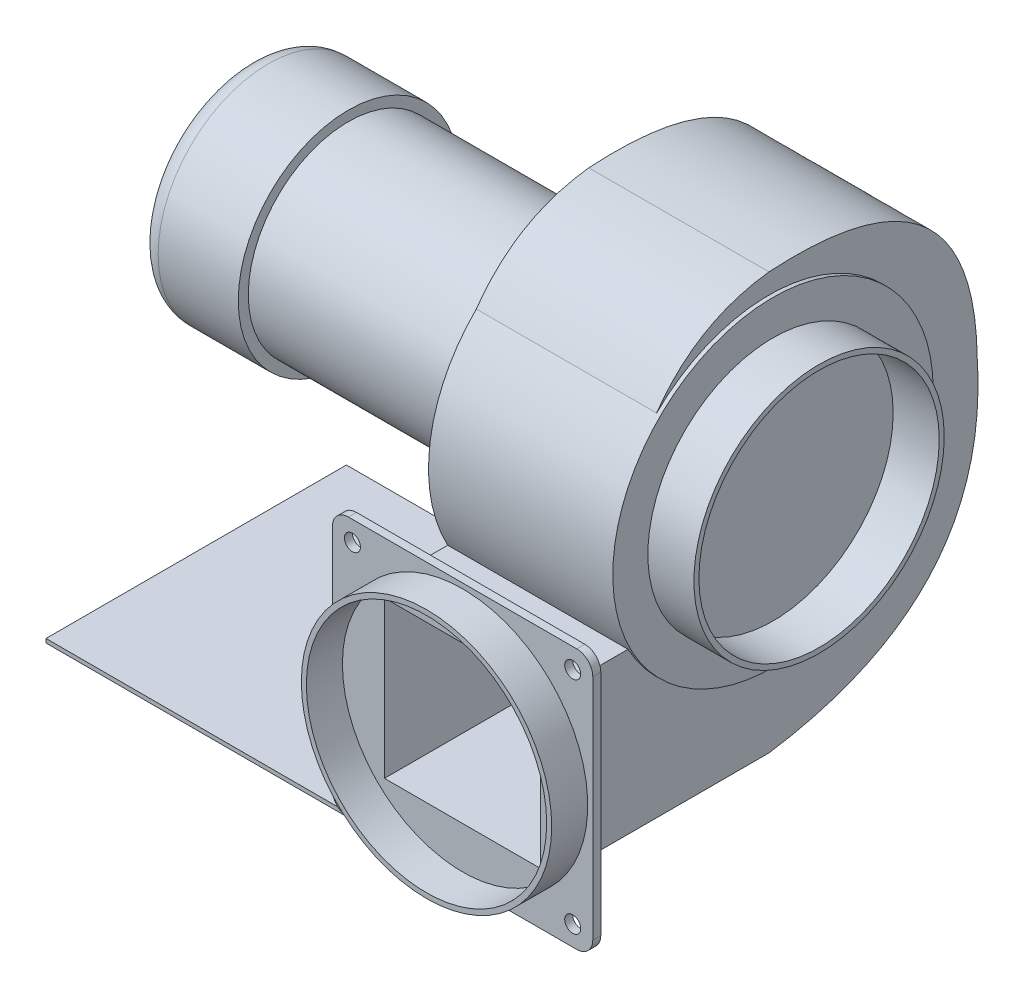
from build123d import *

# Parameters (mm, degrees)
EXTRUDE_1_DEPTH     = 90
EXTRUDE_2_DEPTH     = 4
SKETCH_3_R          = 62.5
SKETCH_3_R_2        = 60
EXTRUDE_3_DEPTH     = 18
SKETCH_4_R          = 4
CUT_EXTRUDE_1_DEPTH = 4
SKETCH_5_R          = 80
EXTRUDE_4_DEPTH     = 2
SKETCH_6_R          = 62.5
SKETCH_6_R_2        = 60
EXTRUDE_5_DEPTH     = 23
SKETCH_7_W          = 78
SKETCH_7_H          = 78
CUT_EXTRUDE_2_DEPTH = 90
SKETCH_8_R          = 50
EXTRUDE_6_DEPTH     = 120
SKETCH_9_R          = 55
EXTRUDE_7_DEPTH     = 50
FILLET_1_R          = 10
SKETCH_10_W         = 150
SKETCH_10_H         = 80
EXTRUDE_8_DEPTH     = 2
SKETCH_11_W         = 150
SKETCH_11_H         = 2
EXTRUDE_9_DEPTH     = 165


with BuildPart() as part:
    # Sketch 1 → Extrude 1 (new body)
    with BuildSketch(Plane(origin=(0, 0, 0), x_dir=(0, 0, -1), z_dir=(1, 0, 0))):
        with BuildLine():
            Line((0, -118), (-104, -118))
            Line((-104, -118), (-104, -38))
            Line((-104, -38), (-70.398863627, -38))
            ThreePointArc((-70.398863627, -38), (-79.113063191, 11.879529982), (-56.133768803, 57))
            add(Edge.make_bspline(
                [(0, 90), (-36.257825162, 85.641840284), (-56.133768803, 57)],
                knots=[0, 0, 0, 1, 1, 1], degree=2))
            add(Edge.make_bspline(
                [(0, 90), (102.835326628, 96.669164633), (104, 0)],
                knots=[0, 0, 0, 1, 1, 1], degree=2))
            add(Edge.make_bspline(
                [(104, 0), (110.598151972, -101.63127149), (0, -118)],
                knots=[0, 0, 0, 1, 1, 1], degree=2))
        make_face()
    extrude(amount=EXTRUDE_1_DEPTH)

    # Sketch 2 → Extrude 2 (add)
    with BuildSketch(Plane.XY.offset(104)):
        with BuildLine():
            Line((-12, -143), (102, -143))
            ThreePointArc((102, -143), (107.656854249, -140.656854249), (110, -135))
            Line((110, -135), (110, -21))
            ThreePointArc((110, -21), (107.656854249, -15.343145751), (102, -13))
            Line((102, -13), (-12, -13))
            ThreePointArc((-12, -13), (-17.656854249, -15.343145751), (-20, -21))
            Line((-20, -21), (-20, -135))
            ThreePointArc((-20, -135), (-17.656854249, -140.656854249), (-12, -143))
        make_face()
    extrude(amount=EXTRUDE_2_DEPTH)

    # Sketch 3 → Extrude 3 (add)
    with BuildSketch(Plane.XY.offset(108)):
        with Locations(Location((45, -78, 0), (0, 0, 180))):
            Circle(SKETCH_3_R)
        with Locations((45, -78)):
            Circle(SKETCH_3_R_2, mode=Mode.SUBTRACT)
    extrude(amount=EXTRUDE_3_DEPTH)

    # Sketch 4 → Cut-Extrude 1 (cut)
    with BuildSketch(Plane.XY.offset(108)):
        with Locations((-10, -23)):
            Circle(SKETCH_4_R)
        with Locations((100, -23)):
            Circle(SKETCH_4_R)
        with Locations((100, -133)):
            Circle(SKETCH_4_R)
        with Locations((-10, -133)):
            Circle(SKETCH_4_R)
    extrude(amount=-CUT_EXTRUDE_1_DEPTH, mode=Mode.SUBTRACT)

    # Sketch 5 → Extrude 4 (add)
    with BuildSketch(Plane(origin=(90, 0, 0), x_dir=(0, 0, -1), z_dir=(1, 0, 0))):
        with Locations(Location((0, 0, 0), (0, 0, 208.359350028))):
            Circle(SKETCH_5_R)
    extrude(amount=EXTRUDE_4_DEPTH)

    # Sketch 6 → Extrude 5 (add)
    with BuildSketch(Plane(origin=(92, 0, 0), x_dir=(0, 0, -1), z_dir=(1, 0, 0))):
        Circle(SKETCH_6_R)
        Circle(SKETCH_6_R_2, mode=Mode.SUBTRACT)
    extrude(amount=EXTRUDE_5_DEPTH)

    # Sketch 7 → Cut-Extrude 2 (cut)
    with BuildSketch(Plane.XY.offset(108)):
        with Locations((45, -78)):
            Rectangle(SKETCH_7_W, SKETCH_7_H)
    extrude(amount=-CUT_EXTRUDE_2_DEPTH, mode=Mode.SUBTRACT)

    # Sketch 8 → Extrude 6 (add)
    with BuildSketch(Plane.ZY):
        Circle(SKETCH_8_R)
    extrude(amount=EXTRUDE_6_DEPTH)

    # Sketch 9 → Extrude 7 (add)
    with BuildSketch(Plane.ZY.offset(120)):
        Circle(SKETCH_9_R)
    extrude(amount=EXTRUDE_7_DEPTH)

    # Fillet 1
    fillet_1_edges = [part.edges().sort_by_distance(p)[0] for p in [
        (-170, 0, -55),
    ]]
    fillet(fillet_1_edges, radius=FILLET_1_R)

    # Sketch 10 → Extrude 8 (add)
    with BuildSketch(Plane.ZY):
        with Locations((29, -107)):
            Rectangle(SKETCH_10_W, SKETCH_10_H)
    extrude(amount=EXTRUDE_8_DEPTH)

    # Sketch 11 → Extrude 9 (add)
    with BuildSketch(Plane.ZY.offset(2)):
        with Locations((29, -146)):
            Rectangle(SKETCH_11_W, SKETCH_11_H)
    extrude(amount=EXTRUDE_9_DEPTH)


solid = part.part
